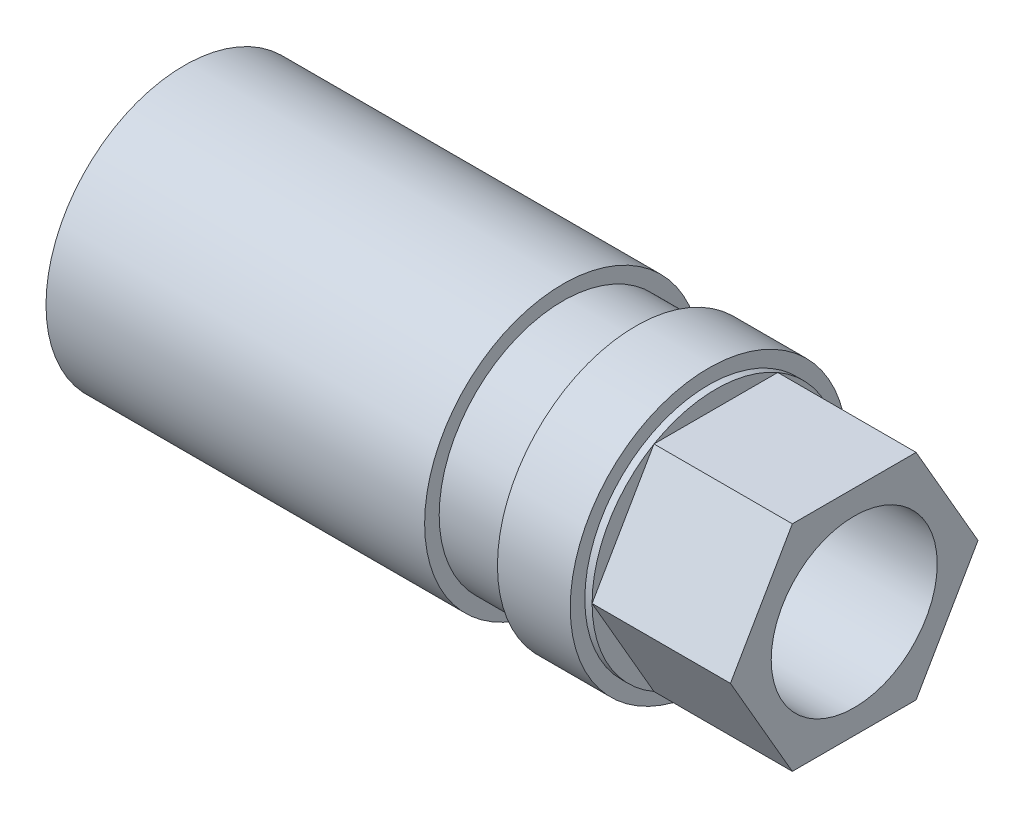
from build123d import *

# Parameters (mm, degrees)
SALIENTE_EXTRUIR1_DEPTH = 9.5
CROQUIS3_R              = 5.7
CORTAR_EXTRUIR1_DEPTH   = 9.5


with BuildPart() as part:
    # Croquis1 → Revoluci_n1 (revolve)
    with BuildSketch(Plane.XY, mode=Mode.PRIVATE) as revoluci_n1_sk:
        Polygon((0, 0), (0, 9.5), (26, 9.5), (26, 8.5), (31, 8.5), (31, 9.5), (36, 9.5), (36, 8.5), (36.5, 8.5), (36.5, 0), align=None)
    revolve(revoluci_n1_sk.sketch.rotate(Axis((0, 0, 0), (1, 0, 0)), 90), axis=Axis((0, 0, 0), (1, 0, 0)))

    # Croquis2 → Saliente-Extruir1 (add)
    with BuildSketch(Plane(origin=(36.5, 0, 0), x_dir=(0, 0, -1), z_dir=(1, 0, 0))):
        Polygon((-4.249901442, 7.361272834), (-8.499999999, 0.000113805), (-4.250098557, -7.361159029), (4.249901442, -7.361272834), (8.499999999, -0.000113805), (4.250098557, 7.361159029), align=None)
    extrude(amount=SALIENTE_EXTRUIR1_DEPTH)

    # Croquis3 → Cortar-Extruir1 (cut)
    with BuildSketch(Plane(origin=(46, 0, 0), x_dir=(0, 0, -1), z_dir=(1, 0, 0))):
        Circle(CROQUIS3_R)
    extrude(amount=-CORTAR_EXTRUIR1_DEPTH, mode=Mode.SUBTRACT)


solid = part.part
